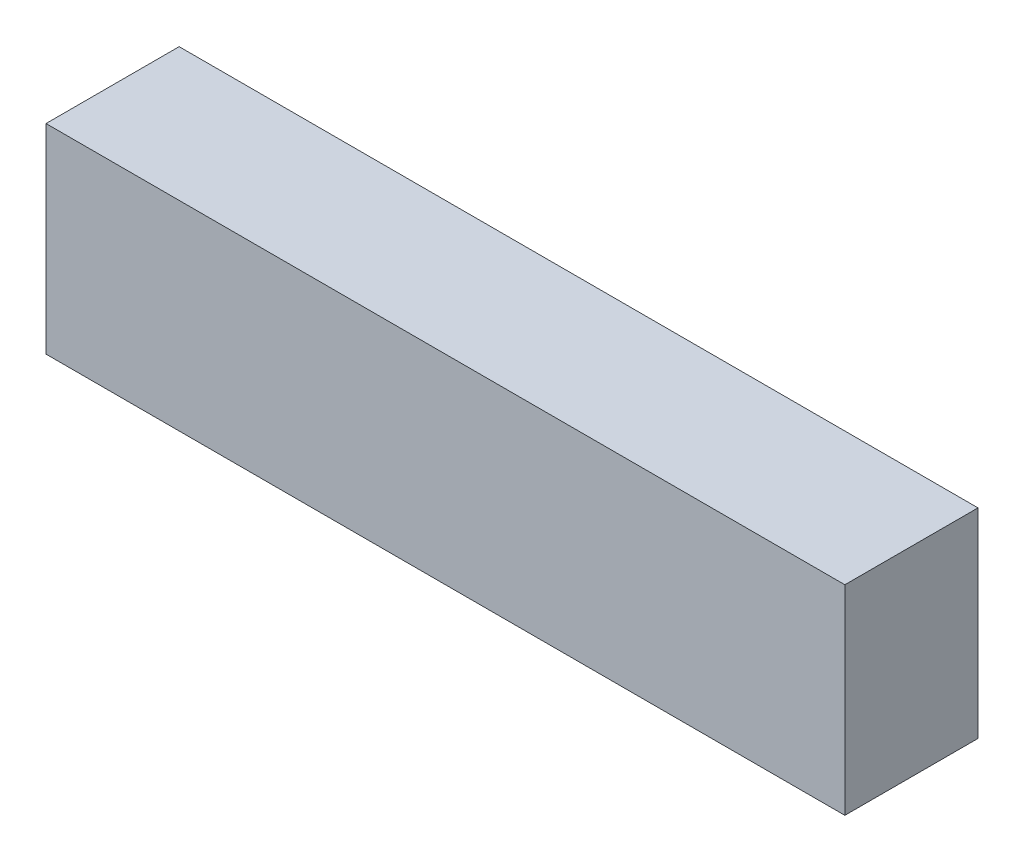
ISO-10303-21;
HEADER;
FILE_DESCRIPTION(('STEP AP214'),'2;1');
FILE_NAME('part.step','',(''),(''),'','','');
FILE_SCHEMA(('AUTOMOTIVE_DESIGN { 1 0 10303 214 1 1 1 1 }'));
ENDSEC;
DATA;
#1=APPLICATION_CONTEXT('core data for automotive mechanical design processes');
#2=APPLICATION_PROTOCOL_DEFINITION('international standard','automotive_design',2000,#1);
#3=PRODUCT_CONTEXT('',#1,'mechanical');
#4=PRODUCT('Part','Part','',(#3));
#5=PRODUCT_RELATED_PRODUCT_CATEGORY('part','',(#4));
#6=PRODUCT_DEFINITION_FORMATION('','',#4);
#7=PRODUCT_DEFINITION_CONTEXT('part definition',#1,'design');
#8=PRODUCT_DEFINITION('design','',#6,#7);
#9=PRODUCT_DEFINITION_SHAPE('','',#8);
#10=(LENGTH_UNIT() NAMED_UNIT(*) SI_UNIT(.MILLI.,.METRE.));
#11=(NAMED_UNIT(*) PLANE_ANGLE_UNIT() SI_UNIT($,.RADIAN.));
#12=(NAMED_UNIT(*) SI_UNIT($,.STERADIAN.) SOLID_ANGLE_UNIT());
#13=UNCERTAINTY_MEASURE_WITH_UNIT(LENGTH_MEASURE(1.E-05),#10,'distance_accuracy_value','');
#14=(GEOMETRIC_REPRESENTATION_CONTEXT(3) GLOBAL_UNCERTAINTY_ASSIGNED_CONTEXT((#13)) GLOBAL_UNIT_ASSIGNED_CONTEXT((#10,
#11,#12)) REPRESENTATION_CONTEXT('',''));
#15=CARTESIAN_POINT('',(0.,0.,0.));
#16=DIRECTION('',(0.,0.,1.));
#17=DIRECTION('',(1.,0.,0.));
#18=AXIS2_PLACEMENT_3D('',#15,#16,#17);
#19=CARTESIAN_POINT('',(-9.,-2.25,3.));
#20=DIRECTION('',(1.,0.,0.));
#21=DIRECTION('',(0.,0.,-1.));
#22=AXIS2_PLACEMENT_3D('',#19,#20,#21);
#23=PLANE('',#22);
#24=DIRECTION('',(0.,-1.,0.));
#25=VECTOR('',#24,1.);
#26=CARTESIAN_POINT('',(-9.,-2.25,0.));
#27=LINE('',#26,#25);
#28=CARTESIAN_POINT('',(-9.,2.25,0.));
#29=VERTEX_POINT('',#28);
#30=CARTESIAN_POINT('',(-9.,-2.25,0.));
#31=VERTEX_POINT('',#30);
#32=EDGE_CURVE('E98',#29,#31,#27,.T.);
#33=ORIENTED_EDGE('',*,*,#32,.T.);
#34=DIRECTION('',(0.,0.,-1.));
#35=VECTOR('',#34,1.);
#36=CARTESIAN_POINT('',(-9.,-2.25,3.));
#37=LINE('',#36,#35);
#38=CARTESIAN_POINT('',(-9.,-2.25,3.));
#39=VERTEX_POINT('',#38);
#40=EDGE_CURVE('E11',#39,#31,#37,.T.);
#41=ORIENTED_EDGE('',*,*,#40,.F.);
#42=DIRECTION('',(0.,-1.,0.));
#43=VECTOR('',#42,1.);
#44=CARTESIAN_POINT('',(-9.,-2.25,3.));
#45=LINE('',#44,#43);
#46=CARTESIAN_POINT('',(-9.,2.25,3.));
#47=VERTEX_POINT('',#46);
#48=EDGE_CURVE('E86',#47,#39,#45,.T.);
#49=ORIENTED_EDGE('',*,*,#48,.F.);
#50=DIRECTION('',(0.,0.,-1.));
#51=VECTOR('',#50,1.);
#52=CARTESIAN_POINT('',(-9.,2.25,3.));
#53=LINE('',#52,#51);
#54=EDGE_CURVE('E94',#47,#29,#53,.T.);
#55=ORIENTED_EDGE('',*,*,#54,.T.);
#56=EDGE_LOOP('',(#33,#41,#49,#55));
#57=FACE_BOUND('',#56,.T.);
#58=ADVANCED_FACE('F35',(#57),#23,.F.);
#59=CARTESIAN_POINT('',(9.,-2.25,3.));
#60=DIRECTION('',(0.,1.,0.));
#61=DIRECTION('',(-1.,0.,0.));
#62=AXIS2_PLACEMENT_3D('',#59,#60,#61);
#63=PLANE('',#62);
#64=DIRECTION('',(1.,0.,0.));
#65=VECTOR('',#64,1.);
#66=CARTESIAN_POINT('',(9.,-2.25,0.));
#67=LINE('',#66,#65);
#68=CARTESIAN_POINT('',(9.,-2.25,0.));
#69=VERTEX_POINT('',#68);
#70=EDGE_CURVE('E90',#31,#69,#67,.T.);
#71=ORIENTED_EDGE('',*,*,#70,.T.);
#72=DIRECTION('',(0.,0.,-1.));
#73=VECTOR('',#72,1.);
#74=CARTESIAN_POINT('',(9.,-2.25,3.));
#75=LINE('',#74,#73);
#76=CARTESIAN_POINT('',(9.,-2.25,3.));
#77=VERTEX_POINT('',#76);
#78=EDGE_CURVE('E43',#77,#69,#75,.T.);
#79=ORIENTED_EDGE('',*,*,#78,.F.);
#80=DIRECTION('',(1.,0.,0.));
#81=VECTOR('',#80,1.);
#82=CARTESIAN_POINT('',(9.,-2.25,3.));
#83=LINE('',#82,#81);
#84=EDGE_CURVE('E81',#39,#77,#83,.T.);
#85=ORIENTED_EDGE('',*,*,#84,.F.);
#86=ORIENTED_EDGE('',*,*,#40,.T.);
#87=EDGE_LOOP('',(#71,#79,#85,#86));
#88=FACE_BOUND('',#87,.T.);
#89=ADVANCED_FACE('F89',(#88),#63,.F.);
#90=CARTESIAN_POINT('',(9.,-2.25,3.));
#91=DIRECTION('',(-1.,0.,0.));
#92=DIRECTION('',(0.,0.,1.));
#93=AXIS2_PLACEMENT_3D('',#90,#91,#92);
#94=PLANE('',#93);
#95=DIRECTION('',(0.,1.,0.));
#96=VECTOR('',#95,1.);
#97=CARTESIAN_POINT('',(9.,-2.25,0.));
#98=LINE('',#97,#96);
#99=CARTESIAN_POINT('',(9.,2.25,0.));
#100=VERTEX_POINT('',#99);
#101=EDGE_CURVE('E68',#69,#100,#98,.T.);
#102=ORIENTED_EDGE('',*,*,#101,.T.);
#103=DIRECTION('',(0.,0.,-1.));
#104=VECTOR('',#103,1.);
#105=CARTESIAN_POINT('',(9.,2.25,3.));
#106=LINE('',#105,#104);
#107=CARTESIAN_POINT('',(9.,2.25,3.));
#108=VERTEX_POINT('',#107);
#109=EDGE_CURVE('E91',#108,#100,#106,.T.);
#110=ORIENTED_EDGE('',*,*,#109,.F.);
#111=DIRECTION('',(0.,1.,0.));
#112=VECTOR('',#111,1.);
#113=CARTESIAN_POINT('',(9.,-2.25,3.));
#114=LINE('',#113,#112);
#115=EDGE_CURVE('E84',#77,#108,#114,.T.);
#116=ORIENTED_EDGE('',*,*,#115,.F.);
#117=ORIENTED_EDGE('',*,*,#78,.T.);
#118=EDGE_LOOP('',(#102,#110,#116,#117));
#119=FACE_BOUND('',#118,.T.);
#120=ADVANCED_FACE('F92',(#119),#94,.F.);
#121=CARTESIAN_POINT('',(9.,2.25,3.));
#122=DIRECTION('',(0.,-1.,0.));
#123=DIRECTION('',(1.,0.,0.));
#124=AXIS2_PLACEMENT_3D('',#121,#122,#123);
#125=PLANE('',#124);
#126=DIRECTION('',(-1.,0.,0.));
#127=VECTOR('',#126,1.);
#128=CARTESIAN_POINT('',(9.,2.25,0.));
#129=LINE('',#128,#127);
#130=EDGE_CURVE('E74',#100,#29,#129,.T.);
#131=ORIENTED_EDGE('',*,*,#130,.T.);
#132=ORIENTED_EDGE('',*,*,#54,.F.);
#133=DIRECTION('',(-1.,0.,0.));
#134=VECTOR('',#133,1.);
#135=CARTESIAN_POINT('',(9.,2.25,3.));
#136=LINE('',#135,#134);
#137=EDGE_CURVE('E51',#108,#47,#136,.T.);
#138=ORIENTED_EDGE('',*,*,#137,.F.);
#139=ORIENTED_EDGE('',*,*,#109,.T.);
#140=EDGE_LOOP('',(#131,#132,#138,#139));
#141=FACE_BOUND('',#140,.T.);
#142=ADVANCED_FACE('F105',(#141),#125,.F.);
#143=CARTESIAN_POINT('',(0.,0.,3.));
#144=DIRECTION('',(0.,0.,1.));
#145=DIRECTION('',(1.,0.,0.));
#146=AXIS2_PLACEMENT_3D('',#143,#144,#145);
#147=PLANE('',#146);
#148=ORIENTED_EDGE('',*,*,#48,.T.);
#149=ORIENTED_EDGE('',*,*,#84,.T.);
#150=ORIENTED_EDGE('',*,*,#115,.T.);
#151=ORIENTED_EDGE('',*,*,#137,.T.);
#152=EDGE_LOOP('',(#148,#149,#150,#151));
#153=FACE_BOUND('',#152,.T.);
#154=ADVANCED_FACE('F82',(#153),#147,.T.);
#155=CARTESIAN_POINT('',(0.,0.,0.));
#156=DIRECTION('',(0.,0.,1.));
#157=DIRECTION('',(1.,0.,0.));
#158=AXIS2_PLACEMENT_3D('',#155,#156,#157);
#159=PLANE('',#158);
#160=ORIENTED_EDGE('',*,*,#32,.F.);
#161=ORIENTED_EDGE('',*,*,#130,.F.);
#162=ORIENTED_EDGE('',*,*,#101,.F.);
#163=ORIENTED_EDGE('',*,*,#70,.F.);
#164=EDGE_LOOP('',(#160,#161,#162,#163));
#165=FACE_BOUND('',#164,.T.);
#166=ADVANCED_FACE('F108',(#165),#159,.F.);
#167=CLOSED_SHELL('',(#58,#89,#120,#142,#154,#166));
#168=MANIFOLD_SOLID_BREP('B2',#167);
#169=ADVANCED_BREP_SHAPE_REPRESENTATION('',(#18,#168),#14);
#170=SHAPE_DEFINITION_REPRESENTATION(#9,#169);
ENDSEC;
END-ISO-10303-21;
